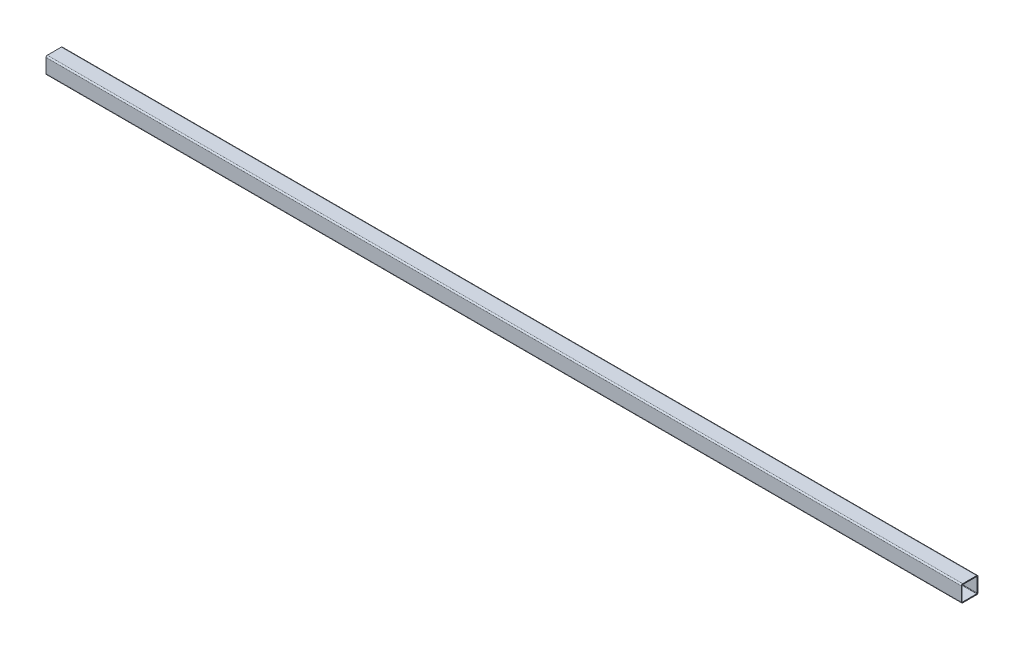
from build123d import *

# Parameters (mm, degrees)
BOSS_EXTRUDE1_DEPTH = 698.5
SCALE1_SCALE_X      = 1
SCALE1_SCALE_Y      = 0.4
SCALE1_SCALE_Z      = 0.4


with BuildPart() as part:
    # Sketch1 → Boss-Extrude1 (new body)
    with BuildSketch(Plane(origin=(0, 0, 0), x_dir=(0, 0, -1), z_dir=(1, 0, 0))):
        with BuildLine():
            Line((0, 2.54), (0, 29.21))
            ThreePointArc((0, 29.21), (-0.743948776, 31.006051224), (-2.54, 31.75))
            Line((-2.54, 31.75), (-29.21, 31.75))
            ThreePointArc((-29.21, 31.75), (-31.006051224, 31.006051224), (-31.75, 29.21))
            Line((-31.75, 29.21), (-31.75, 2.54))
            ThreePointArc((-31.75, 2.54), (-31.006051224, 0.743948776), (-29.21, 0))
            Line((-29.21, 0), (-2.54, 0))
            ThreePointArc((-2.54, 0), (-0.743948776, 0.743948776), (0, 2.54))
        make_face()
        with BuildLine():
            Line((-1.651, 2.54), (-1.651, 29.21))
            ThreePointArc((-1.651, 29.21), (-1.911382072, 29.838617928), (-2.54, 30.099))
            Line((-2.54, 30.099), (-29.21, 30.099))
            ThreePointArc((-29.21, 30.099), (-29.838617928, 29.838617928), (-30.099, 29.21))
            Line((-30.099, 29.21), (-30.099, 2.54))
            ThreePointArc((-30.099, 2.54), (-29.838617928, 1.911382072), (-29.21, 1.651))
            Line((-29.21, 1.651), (-2.54, 1.651))
            ThreePointArc((-2.54, 1.651), (-1.911382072, 1.911382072), (-1.651, 2.54))
        make_face(mode=Mode.SUBTRACT)
    extrude(amount=BOSS_EXTRUDE1_DEPTH)


with BuildPart() as part_1:
    # Scale1: scaled about (349.25, 15.875, 15.875)
    add(part.part.scale((SCALE1_SCALE_X, SCALE1_SCALE_Y, SCALE1_SCALE_Z), about=(349.25, 15.875, 15.875)))


solid = part_1.part
